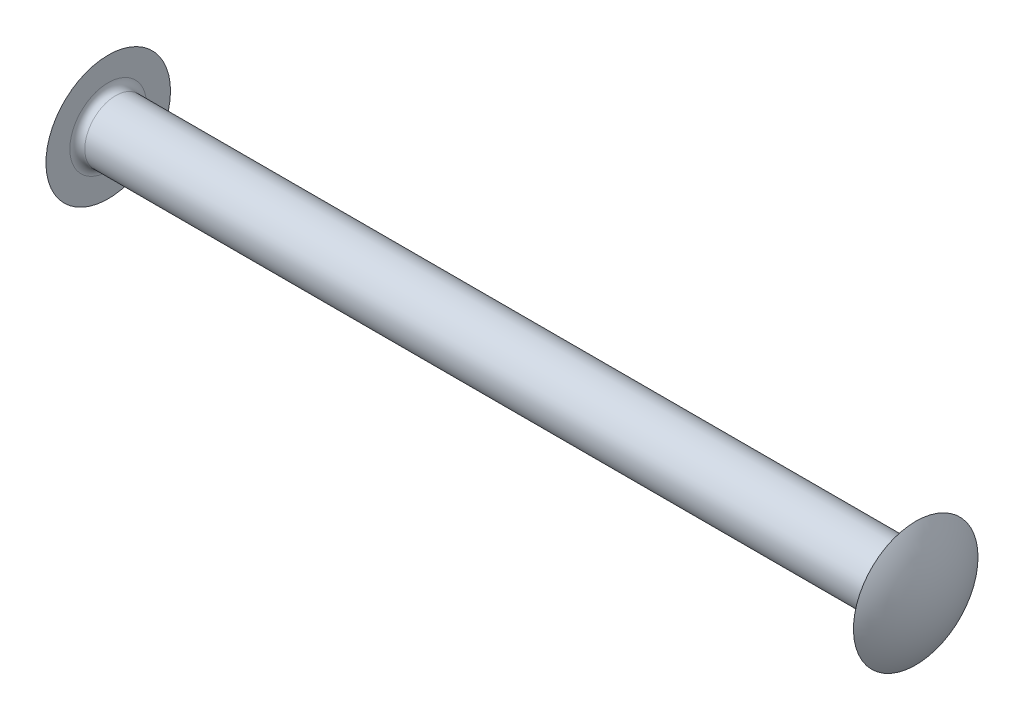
ISO-10303-21;
HEADER;
FILE_DESCRIPTION(('STEP AP214'),'2;1');
FILE_NAME('part.step','',(''),(''),'','','');
FILE_SCHEMA(('AUTOMOTIVE_DESIGN { 1 0 10303 214 1 1 1 1 }'));
ENDSEC;
DATA;
#1=APPLICATION_CONTEXT('core data for automotive mechanical design processes');
#2=APPLICATION_PROTOCOL_DEFINITION('international standard','automotive_design',2000,#1);
#3=PRODUCT_CONTEXT('',#1,'mechanical');
#4=PRODUCT('Part','Part','',(#3));
#5=PRODUCT_RELATED_PRODUCT_CATEGORY('part','',(#4));
#6=PRODUCT_DEFINITION_FORMATION('','',#4);
#7=PRODUCT_DEFINITION_CONTEXT('part definition',#1,'design');
#8=PRODUCT_DEFINITION('design','',#6,#7);
#9=PRODUCT_DEFINITION_SHAPE('','',#8);
#10=(LENGTH_UNIT() NAMED_UNIT(*) SI_UNIT(.MILLI.,.METRE.));
#11=(NAMED_UNIT(*) PLANE_ANGLE_UNIT() SI_UNIT($,.RADIAN.));
#12=(NAMED_UNIT(*) SI_UNIT($,.STERADIAN.) SOLID_ANGLE_UNIT());
#13=UNCERTAINTY_MEASURE_WITH_UNIT(LENGTH_MEASURE(1.E-05),#10,'distance_accuracy_value','');
#14=(GEOMETRIC_REPRESENTATION_CONTEXT(3) GLOBAL_UNCERTAINTY_ASSIGNED_CONTEXT((#13)) GLOBAL_UNIT_ASSIGNED_CONTEXT((#10,
#11,#12)) REPRESENTATION_CONTEXT('',''));
#15=CARTESIAN_POINT('',(0.,0.,0.));
#16=DIRECTION('',(0.,0.,1.));
#17=DIRECTION('',(1.,0.,0.));
#18=AXIS2_PLACEMENT_3D('',#15,#16,#17);
#19=CARTESIAN_POINT('',(31.987717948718,44.6532,-79.0956));
#20=DIRECTION('',(1.,0.,0.));
#21=DIRECTION('',(0.,1.,0.));
#22=AXIS2_PLACEMENT_3D('',#19,#20,#21);
#23=SPHERICAL_SURFACE('',#22,11.166882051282);
#24=CARTESIAN_POINT('',(43.1546,44.6532,-79.0956));
#25=VERTEX_POINT('',#24);
#26=VERTEX_LOOP('',#25);
#27=FACE_BOUND('',#26,.T.);
#28=CARTESIAN_POINT('',(41.1734,44.6532,-79.0956));
#29=DIRECTION('',(1.,0.,0.));
#30=DIRECTION('',(0.,0.,-1.));
#31=AXIS2_PLACEMENT_3D('',#28,#29,#30);
#32=CIRCLE('',#31,6.35000000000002);
#33=CARTESIAN_POINT('',(41.1734,44.6532,-85.4456));
#34=VERTEX_POINT('',#33);
#35=EDGE_CURVE('E20',#34,#34,#32,.F.);
#36=ORIENTED_EDGE('',*,*,#35,.F.);
#37=EDGE_LOOP('',(#36));
#38=FACE_BOUND('',#37,.T.);
#39=ADVANCED_FACE('F16',(#27,#38),#23,.T.);
#40=CARTESIAN_POINT('',(-31.9877179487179,44.6532,-79.0956));
#41=DIRECTION('',(1.,0.,0.));
#42=DIRECTION('',(0.,1.,0.));
#43=AXIS2_PLACEMENT_3D('',#40,#41,#42);
#44=SPHERICAL_SURFACE('',#43,11.1668820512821);
#45=CARTESIAN_POINT('',(-43.1546,44.6532,-79.0956));
#46=VERTEX_POINT('',#45);
#47=VERTEX_LOOP('',#46);
#48=FACE_BOUND('',#47,.T.);
#49=CARTESIAN_POINT('',(-41.1734,44.6532,-79.0956));
#50=DIRECTION('',(1.,0.,0.));
#51=DIRECTION('',(0.,0.,-1.));
#52=AXIS2_PLACEMENT_3D('',#49,#50,#51);
#53=CIRCLE('',#52,6.35);
#54=CARTESIAN_POINT('',(-41.1734,44.6532,-85.4456));
#55=VERTEX_POINT('',#54);
#56=EDGE_CURVE('E38',#55,#55,#53,.T.);
#57=ORIENTED_EDGE('',*,*,#56,.F.);
#58=EDGE_LOOP('',(#57));
#59=FACE_BOUND('',#58,.T.);
#60=ADVANCED_FACE('F34',(#48,#59),#44,.T.);
#61=CARTESIAN_POINT('',(41.1734,50.9942843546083,-78.7592234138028));
#62=DIRECTION('',(-1.,0.,0.));
#63=DIRECTION('',(0.,0.,1.));
#64=AXIS2_PLACEMENT_3D('',#61,#62,#63);
#65=PLANE('',#64);
#66=CARTESIAN_POINT('',(41.1734,44.6532,-79.0956));
#67=DIRECTION('',(-1.,0.,0.));
#68=DIRECTION('',(0.,-0.0529726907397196,0.99859596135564));
#69=AXIS2_PLACEMENT_3D('',#66,#67,#68);
#70=CIRCLE('',#69,3.9116);
#71=CARTESIAN_POINT('',(41.1734,44.4459920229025,-75.1894920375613));
#72=VERTEX_POINT('',#71);
#73=EDGE_CURVE('E40',#72,#72,#70,.F.);
#74=ORIENTED_EDGE('',*,*,#73,.T.);
#75=EDGE_LOOP('',(#74));
#76=FACE_BOUND('',#75,.T.);
#77=ORIENTED_EDGE('',*,*,#35,.T.);
#78=EDGE_LOOP('',(#77));
#79=FACE_BOUND('',#78,.T.);
#80=ADVANCED_FACE('F55',(#76,#79),#65,.T.);
#81=CARTESIAN_POINT('',(-41.1734,47.7983778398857,-78.9287572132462));
#82=DIRECTION('',(1.,0.,0.));
#83=DIRECTION('',(0.,0.,-1.));
#84=AXIS2_PLACEMENT_3D('',#81,#82,#83);
#85=PLANE('',#84);
#86=CARTESIAN_POINT('',(-41.1734,44.6532,-79.0956));
#87=DIRECTION('',(1.,0.,0.));
#88=DIRECTION('',(0.,0.0529726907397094,-0.99859596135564));
#89=AXIS2_PLACEMENT_3D('',#86,#87,#88);
#90=CIRCLE('',#89,3.91159999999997);
#91=CARTESIAN_POINT('',(-41.1734,44.8604079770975,-83.0017079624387));
#92=VERTEX_POINT('',#91);
#93=EDGE_CURVE('E44',#92,#92,#90,.F.);
#94=ORIENTED_EDGE('',*,*,#93,.T.);
#95=EDGE_LOOP('',(#94));
#96=FACE_BOUND('',#95,.T.);
#97=ORIENTED_EDGE('',*,*,#56,.T.);
#98=EDGE_LOOP('',(#97));
#99=FACE_BOUND('',#98,.T.);
#100=ADVANCED_FACE('F59',(#96,#99),#85,.T.);
#101=CARTESIAN_POINT('',(40.4114,44.6532,-79.0956));
#102=DIRECTION('',(-1.,0.,0.));
#103=DIRECTION('',(0.,0.,1.));
#104=AXIS2_PLACEMENT_3D('',#101,#102,#103);
#105=TOROIDAL_SURFACE('',#104,3.91159999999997,0.762);
#106=ORIENTED_EDGE('',*,*,#73,.F.);
#107=EDGE_LOOP('',(#106));
#108=FACE_BOUND('',#107,.T.);
#109=CARTESIAN_POINT('',(40.4114,44.6532,-79.0956));
#110=DIRECTION('',(-1.,0.,0.));
#111=DIRECTION('',(0.,0.,1.));
#112=AXIS2_PLACEMENT_3D('',#109,#110,#111);
#113=CIRCLE('',#112,3.14959999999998);
#114=CARTESIAN_POINT('',(40.4114,44.6532,-75.946));
#115=VERTEX_POINT('',#114);
#116=EDGE_CURVE('E26',#115,#115,#113,.T.);
#117=ORIENTED_EDGE('',*,*,#116,.F.);
#118=EDGE_LOOP('',(#117));
#119=FACE_BOUND('',#118,.T.);
#120=ADVANCED_FACE('F74',(#108,#119),#105,.F.);
#121=CARTESIAN_POINT('',(-40.4114,44.6532,-79.0956));
#122=DIRECTION('',(1.,0.,0.));
#123=DIRECTION('',(0.,0.,-1.));
#124=AXIS2_PLACEMENT_3D('',#121,#122,#123);
#125=TOROIDAL_SURFACE('',#124,3.91159999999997,0.762);
#126=ORIENTED_EDGE('',*,*,#93,.F.);
#127=EDGE_LOOP('',(#126));
#128=FACE_BOUND('',#127,.T.);
#129=CARTESIAN_POINT('',(-40.4114,44.6532,-79.0956));
#130=DIRECTION('',(-1.,0.,0.));
#131=DIRECTION('',(0.,0.,1.));
#132=AXIS2_PLACEMENT_3D('',#129,#130,#131);
#133=CIRCLE('',#132,3.14959999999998);
#134=CARTESIAN_POINT('',(-40.4114,44.6532,-75.946));
#135=VERTEX_POINT('',#134);
#136=EDGE_CURVE('E11',#135,#135,#133,.F.);
#137=ORIENTED_EDGE('',*,*,#136,.F.);
#138=EDGE_LOOP('',(#137));
#139=FACE_BOUND('',#138,.T.);
#140=ADVANCED_FACE('F77',(#128,#139),#125,.F.);
#141=CARTESIAN_POINT('',(-102.297406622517,44.6532,-79.0956));
#142=DIRECTION('',(-1.,0.,0.));
#143=DIRECTION('',(0.,0.,1.));
#144=AXIS2_PLACEMENT_3D('',#141,#142,#143);
#145=CYLINDRICAL_SURFACE('',#144,3.14959999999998);
#146=ORIENTED_EDGE('',*,*,#136,.T.);
#147=EDGE_LOOP('',(#146));
#148=FACE_BOUND('',#147,.T.);
#149=ORIENTED_EDGE('',*,*,#116,.T.);
#150=EDGE_LOOP('',(#149));
#151=FACE_BOUND('',#150,.T.);
#152=ADVANCED_FACE('F96',(#148,#151),#145,.T.);
#153=CLOSED_SHELL('',(#39,#60,#80,#100,#120,#140,#152));
#154=MANIFOLD_SOLID_BREP('B1',#153);
#155=ADVANCED_BREP_SHAPE_REPRESENTATION('',(#18,#154),#14);
#156=SHAPE_DEFINITION_REPRESENTATION(#9,#155);
ENDSEC;
END-ISO-10303-21;
